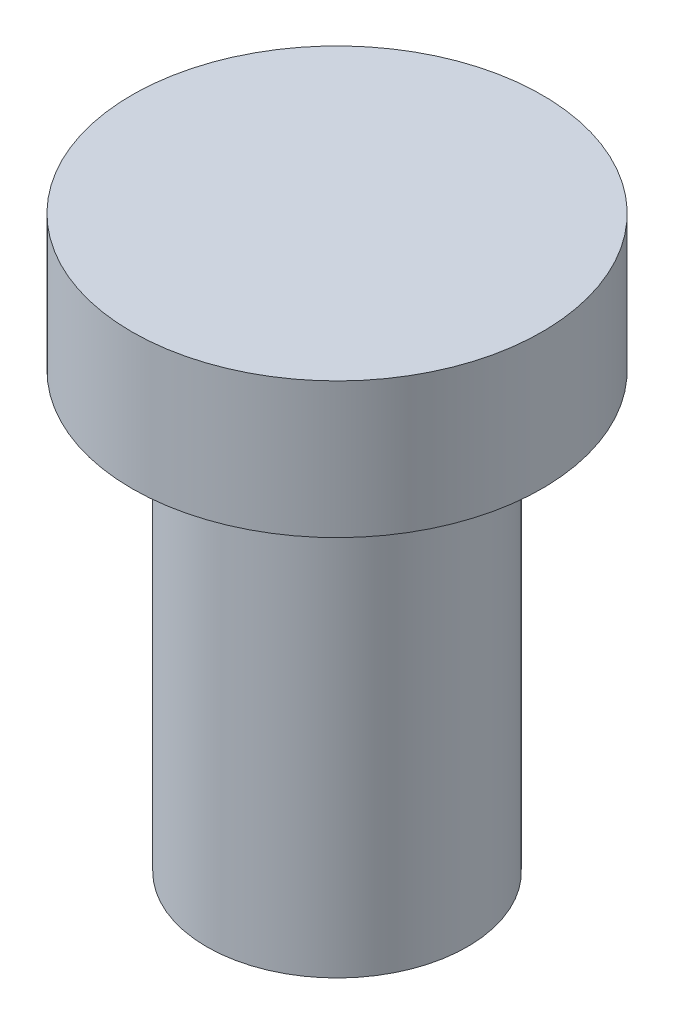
from build123d import *

# Parameters (mm, degrees)
SKETCH1_R      = 3.05
EXTRUDE1_DEPTH = 10.16
SKETCH2_R      = 4.799937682
EXTRUDE2_DEPTH = 3.175


with BuildPart() as part:
    # Sketch1 → Extrude1 (new body)
    with BuildSketch(Plane(origin=(0, 0, 0), x_dir=(1, 0, 0), z_dir=(0, 1, 0))):
        with Locations(Location((0, 0, 0), (0, 0, 270))):
            Circle(SKETCH1_R)
    extrude(amount=EXTRUDE1_DEPTH)

    # Sketch2 → Extrude2 (add)
    with BuildSketch(Plane(origin=(0, 10.16, 0), x_dir=(-1, 0, 0), z_dir=(0, 1, 0))):
        with Locations(Location((0, 0, 0), (0, 0, 90))):
            Circle(SKETCH2_R)
    extrude(amount=EXTRUDE2_DEPTH)


solid = part.part
